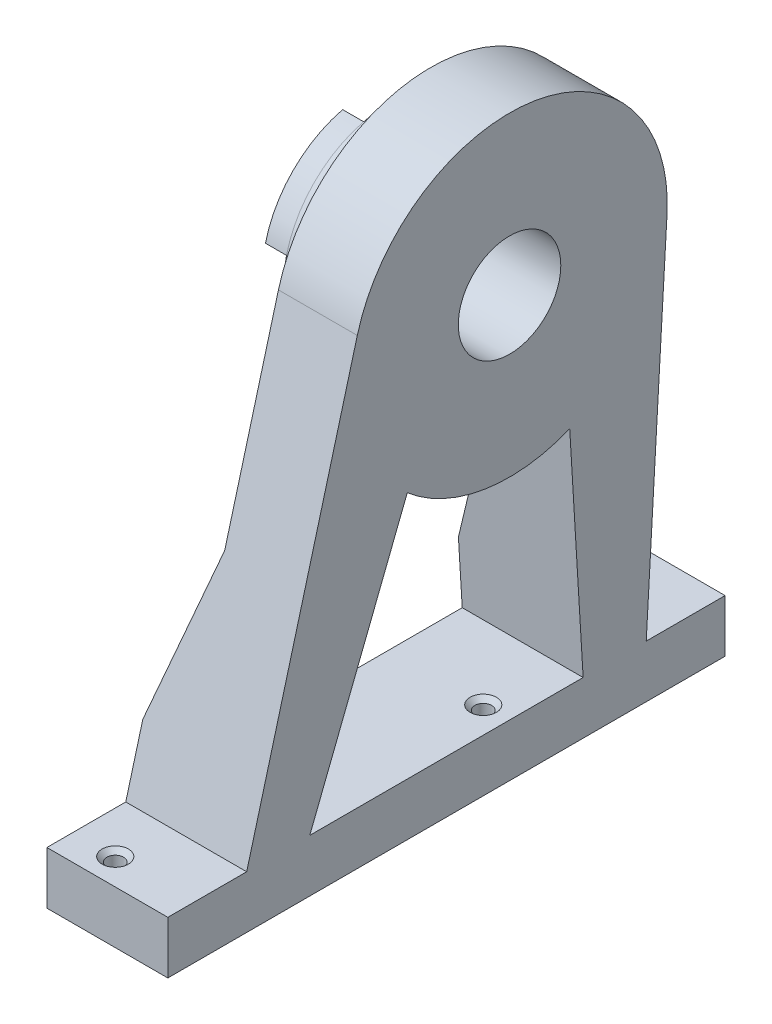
ISO-10303-21;
HEADER;
FILE_DESCRIPTION(('STEP AP214'),'2;1');
FILE_NAME('part.step','',(''),(''),'','','');
FILE_SCHEMA(('AUTOMOTIVE_DESIGN { 1 0 10303 214 1 1 1 1 }'));
ENDSEC;
DATA;
#1=APPLICATION_CONTEXT('core data for automotive mechanical design processes');
#2=APPLICATION_PROTOCOL_DEFINITION('international standard','automotive_design',2000,#1);
#3=PRODUCT_CONTEXT('',#1,'mechanical');
#4=PRODUCT('Part','Part','',(#3));
#5=PRODUCT_RELATED_PRODUCT_CATEGORY('part','',(#4));
#6=PRODUCT_DEFINITION_FORMATION('','',#4);
#7=PRODUCT_DEFINITION_CONTEXT('part definition',#1,'design');
#8=PRODUCT_DEFINITION('design','',#6,#7);
#9=PRODUCT_DEFINITION_SHAPE('','',#8);
#10=(LENGTH_UNIT() NAMED_UNIT(*) SI_UNIT(.MILLI.,.METRE.));
#11=(NAMED_UNIT(*) PLANE_ANGLE_UNIT() SI_UNIT($,.RADIAN.));
#12=(NAMED_UNIT(*) SI_UNIT($,.STERADIAN.) SOLID_ANGLE_UNIT());
#13=UNCERTAINTY_MEASURE_WITH_UNIT(LENGTH_MEASURE(1.E-05),#10,'distance_accuracy_value','');
#14=(GEOMETRIC_REPRESENTATION_CONTEXT(3) GLOBAL_UNCERTAINTY_ASSIGNED_CONTEXT((#13)) GLOBAL_UNIT_ASSIGNED_CONTEXT((#10,
#11,#12)) REPRESENTATION_CONTEXT('',''));
#15=CARTESIAN_POINT('',(0.,0.,0.));
#16=DIRECTION('',(0.,0.,1.));
#17=DIRECTION('',(1.,0.,0.));
#18=AXIS2_PLACEMENT_3D('',#15,#16,#17);
#19=CARTESIAN_POINT('',(-27.,80.,0.));
#20=DIRECTION('',(1.,0.,0.));
#21=DIRECTION('',(0.,0.,-1.));
#22=AXIS2_PLACEMENT_3D('',#19,#20,#21);
#23=CYLINDRICAL_SURFACE('',#22,20.);
#24=DIRECTION('',(-1.,0.,0.));
#25=VECTOR('',#24,1.);
#26=CARTESIAN_POINT('',(-23.,75.25,-19.4277507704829));
#27=LINE('',#26,#25);
#28=CARTESIAN_POINT('',(-23.,75.25,-19.4277507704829));
#29=VERTEX_POINT('',#28);
#30=CARTESIAN_POINT('',(-27.,75.25,-19.4277507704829));
#31=VERTEX_POINT('',#30);
#32=EDGE_CURVE('E596',#29,#31,#27,.T.);
#33=ORIENTED_EDGE('',*,*,#32,.F.);
#34=CARTESIAN_POINT('',(-23.,80.,0.));
#35=DIRECTION('',(1.,0.,0.));
#36=DIRECTION('',(0.,1.,0.));
#37=AXIS2_PLACEMENT_3D('',#34,#35,#36);
#38=CIRCLE('',#37,20.);
#39=CARTESIAN_POINT('',(-23.,60.5722492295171,-4.75));
#40=VERTEX_POINT('',#39);
#41=EDGE_CURVE('E12',#29,#40,#38,.F.);
#42=ORIENTED_EDGE('',*,*,#41,.T.);
#43=DIRECTION('',(-1.,0.,0.));
#44=VECTOR('',#43,1.);
#45=CARTESIAN_POINT('',(-23.,60.5722492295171,-4.75));
#46=LINE('',#45,#44);
#47=CARTESIAN_POINT('',(-27.,60.5722492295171,-4.74999999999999));
#48=VERTEX_POINT('',#47);
#49=EDGE_CURVE('E601',#40,#48,#46,.T.);
#50=ORIENTED_EDGE('',*,*,#49,.T.);
#51=CARTESIAN_POINT('',(-27.,80.,0.));
#52=DIRECTION('',(1.,0.,0.));
#53=DIRECTION('',(0.,0.,-1.));
#54=AXIS2_PLACEMENT_3D('',#51,#52,#53);
#55=CIRCLE('',#54,20.);
#56=EDGE_CURVE('E317',#48,#31,#55,.T.);
#57=ORIENTED_EDGE('',*,*,#56,.T.);
#58=EDGE_LOOP('',(#33,#42,#50,#57));
#59=FACE_BOUND('',#58,.T.);
#60=ADVANCED_FACE('F33',(#59),#23,.T.);
#61=CARTESIAN_POINT('',(-25.,9.99999999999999,50.));
#62=DIRECTION('',(0.,0.260963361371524,0.965348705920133));
#63=DIRECTION('',(0.,-0.965348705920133,0.260963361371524));
#64=AXIS2_PLACEMENT_3D('',#61,#62,#63);
#65=PLANE('',#64);
#66=DIRECTION('',(0.26588586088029,0.930600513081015,-0.251569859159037));
#67=VECTOR('',#66,1.);
#68=CARTESIAN_POINT('',(-26.3275781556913,10.3534764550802,49.9044444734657));
#69=LINE('',#68,#67);
#70=CARTESIAN_POINT('',(-23.,22.,46.7560319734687));
#71=VERTEX_POINT('',#70);
#72=CARTESIAN_POINT('',(-15.,50.,39.1867732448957));
#73=VERTEX_POINT('',#72);
#74=EDGE_CURVE('E343',#71,#73,#69,.T.);
#75=ORIENTED_EDGE('',*,*,#74,.F.);
#76=DIRECTION('',(0.,-0.965348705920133,0.260963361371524));
#77=VECTOR('',#76,1.);
#78=CARTESIAN_POINT('',(-23.,9.99999999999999,50.));
#79=LINE('',#78,#77);
#80=CARTESIAN_POINT('',(-23.,9.99999999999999,50.));
#81=VERTEX_POINT('',#80);
#82=EDGE_CURVE('E48',#71,#81,#79,.T.);
#83=ORIENTED_EDGE('',*,*,#82,.T.);
#84=DIRECTION('',(1.,0.,0.));
#85=VECTOR('',#84,1.);
#86=CARTESIAN_POINT('',(-25.,9.99999999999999,50.));
#87=LINE('',#86,#85);
#88=CARTESIAN_POINT('',(0.,9.99999999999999,50.));
#89=VERTEX_POINT('',#88);
#90=EDGE_CURVE('E389',#81,#89,#87,.T.);
#91=ORIENTED_EDGE('',*,*,#90,.T.);
#92=DIRECTION('',(0.,-0.965348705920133,0.260963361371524));
#93=VECTOR('',#92,1.);
#94=CARTESIAN_POINT('',(0.,9.99999999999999,50.));
#95=LINE('',#94,#93);
#96=CARTESIAN_POINT('',(0.,87.8289008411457,28.960461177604));
#97=VERTEX_POINT('',#96);
#98=EDGE_CURVE('E360',#97,#89,#95,.T.);
#99=ORIENTED_EDGE('',*,*,#98,.F.);
#100=DIRECTION('',(1.,0.,0.));
#101=VECTOR('',#100,1.);
#102=CARTESIAN_POINT('',(-25.,87.8289008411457,28.960461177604));
#103=LINE('',#102,#101);
#104=CARTESIAN_POINT('',(-15.,87.8289008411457,28.960461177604));
#105=VERTEX_POINT('',#104);
#106=EDGE_CURVE('E390',#105,#97,#103,.T.);
#107=ORIENTED_EDGE('',*,*,#106,.F.);
#108=DIRECTION('',(0.,0.965348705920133,-0.260963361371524));
#109=VECTOR('',#108,1.);
#110=CARTESIAN_POINT('',(-15.,9.99999999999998,50.));
#111=LINE('',#110,#109);
#112=EDGE_CURVE('E335',#73,#105,#111,.T.);
#113=ORIENTED_EDGE('',*,*,#112,.F.);
#114=EDGE_LOOP('',(#75,#83,#91,#99,#107,#113));
#115=FACE_BOUND('',#114,.T.);
#116=ADVANCED_FACE('F458',(#115),#65,.T.);
#117=CARTESIAN_POINT('',(-25.,9.99999999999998,-26.));
#118=DIRECTION('',(0.,-0.057763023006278,-0.998330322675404));
#119=DIRECTION('',(0.,0.998330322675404,-0.057763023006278));
#120=AXIS2_PLACEMENT_3D('',#117,#118,#119);
#121=PLANE('',#120);
#122=DIRECTION('',(1.,0.,0.));
#123=VECTOR('',#122,1.);
#124=CARTESIAN_POINT('',(-25.,9.99999999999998,-26.));
#125=LINE('',#124,#123);
#126=CARTESIAN_POINT('',(-23.,9.99999999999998,-26.));
#127=VERTEX_POINT('',#126);
#128=CARTESIAN_POINT('',(0.,9.99999999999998,-26.));
#129=VERTEX_POINT('',#128);
#130=EDGE_CURVE('E395',#127,#129,#125,.T.);
#131=ORIENTED_EDGE('',*,*,#130,.F.);
#132=DIRECTION('',(0.,0.998330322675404,-0.057763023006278));
#133=VECTOR('',#132,1.);
#134=CARTESIAN_POINT('',(-23.,9.99999999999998,-26.));
#135=LINE('',#134,#133);
#136=CARTESIAN_POINT('',(-23.,22.,-26.6943155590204));
#137=VERTEX_POINT('',#136);
#138=EDGE_CURVE('E292',#127,#137,#135,.T.);
#139=ORIENTED_EDGE('',*,*,#138,.T.);
#140=DIRECTION('',(-0.274296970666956,-0.960039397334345,0.0555475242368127));
#141=VECTOR('',#140,1.);
#142=CARTESIAN_POINT('',(-26.3210873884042,10.3761941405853,-26.0217664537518));
#143=LINE('',#142,#141);
#144=CARTESIAN_POINT('',(-15.,50.,-28.3143851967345));
#145=VERTEX_POINT('',#144);
#146=EDGE_CURVE('E340',#145,#137,#143,.T.);
#147=ORIENTED_EDGE('',*,*,#146,.F.);
#148=DIRECTION('',(0.,-0.998330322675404,0.057763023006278));
#149=VECTOR('',#148,1.);
#150=CARTESIAN_POINT('',(-15.,9.99999999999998,-26.));
#151=LINE('',#150,#149);
#152=CARTESIAN_POINT('',(-15.,78.2671093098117,-29.9499096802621));
#153=VERTEX_POINT('',#152);
#154=EDGE_CURVE('E331',#153,#145,#151,.T.);
#155=ORIENTED_EDGE('',*,*,#154,.F.);
#156=DIRECTION('',(1.,0.,0.));
#157=VECTOR('',#156,1.);
#158=CARTESIAN_POINT('',(-25.,78.2671093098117,-29.9499096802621));
#159=LINE('',#158,#157);
#160=CARTESIAN_POINT('',(0.,78.2671093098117,-29.9499096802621));
#161=VERTEX_POINT('',#160);
#162=EDGE_CURVE('E393',#153,#161,#159,.T.);
#163=ORIENTED_EDGE('',*,*,#162,.T.);
#164=DIRECTION('',(0.,0.998330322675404,-0.057763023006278));
#165=VECTOR('',#164,1.);
#166=CARTESIAN_POINT('',(0.,9.99999999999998,-26.));
#167=LINE('',#166,#165);
#168=EDGE_CURVE('E383',#129,#161,#167,.T.);
#169=ORIENTED_EDGE('',*,*,#168,.F.);
#170=EDGE_LOOP('',(#131,#139,#147,#155,#163,#169));
#171=FACE_BOUND('',#170,.T.);
#172=ADVANCED_FACE('F464',(#171),#121,.T.);
#173=CARTESIAN_POINT('',(-25.,10.,-41.));
#174=DIRECTION('',(0.,1.,0.));
#175=DIRECTION('',(0.,0.,1.));
#176=AXIS2_PLACEMENT_3D('',#173,#174,#175);
#177=PLANE('',#176);
#178=CARTESIAN_POINT('',(-15.,9.99999999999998,-36.));
#179=DIRECTION('',(0.,1.,0.));
#180=DIRECTION('',(0.,0.,1.));
#181=AXIS2_PLACEMENT_3D('',#178,#179,#180);
#182=CIRCLE('',#181,2.5);
#183=CARTESIAN_POINT('',(-15.,9.99999999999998,-33.5));
#184=VERTEX_POINT('',#183);
#185=EDGE_CURVE('E910',#184,#184,#182,.T.);
#186=ORIENTED_EDGE('',*,*,#185,.F.);
#187=EDGE_LOOP('',(#186));
#188=FACE_BOUND('',#187,.T.);
#189=DIRECTION('',(1.,0.,0.));
#190=VECTOR('',#189,1.);
#191=CARTESIAN_POINT('',(-25.,10.,-41.));
#192=LINE('',#191,#190);
#193=CARTESIAN_POINT('',(-23.,10.,-41.));
#194=VERTEX_POINT('',#193);
#195=CARTESIAN_POINT('',(0.,10.,-41.));
#196=VERTEX_POINT('',#195);
#197=EDGE_CURVE('E397',#194,#196,#192,.T.);
#198=ORIENTED_EDGE('',*,*,#197,.F.);
#199=DIRECTION('',(0.,0.,1.));
#200=VECTOR('',#199,1.);
#201=CARTESIAN_POINT('',(-23.,10.,-41.));
#202=LINE('',#201,#200);
#203=EDGE_CURVE('E289',#194,#127,#202,.T.);
#204=ORIENTED_EDGE('',*,*,#203,.T.);
#205=ORIENTED_EDGE('',*,*,#130,.T.);
#206=DIRECTION('',(0.,0.,1.));
#207=VECTOR('',#206,1.);
#208=CARTESIAN_POINT('',(0.,10.,-41.));
#209=LINE('',#208,#207);
#210=EDGE_CURVE('E380',#196,#129,#209,.T.);
#211=ORIENTED_EDGE('',*,*,#210,.F.);
#212=EDGE_LOOP('',(#198,#204,#205,#211));
#213=FACE_BOUND('',#212,.T.);
#214=ADVANCED_FACE('F515',(#188,#213),#177,.T.);
#215=CARTESIAN_POINT('',(-25.,10.,-41.));
#216=DIRECTION('',(0.,0.,-1.));
#217=DIRECTION('',(-1.,0.,0.));
#218=AXIS2_PLACEMENT_3D('',#215,#216,#217);
#219=PLANE('',#218);
#220=DIRECTION('',(1.,0.,0.));
#221=VECTOR('',#220,1.);
#222=CARTESIAN_POINT('',(-25.,0.,-41.));
#223=LINE('',#222,#221);
#224=CARTESIAN_POINT('',(-23.,0.,-41.));
#225=VERTEX_POINT('',#224);
#226=CARTESIAN_POINT('',(0.,0.,-41.));
#227=VERTEX_POINT('',#226);
#228=EDGE_CURVE('E399',#225,#227,#223,.T.);
#229=ORIENTED_EDGE('',*,*,#228,.F.);
#230=DIRECTION('',(0.,1.,0.));
#231=VECTOR('',#230,1.);
#232=CARTESIAN_POINT('',(-23.,10.,-41.));
#233=LINE('',#232,#231);
#234=EDGE_CURVE('E286',#225,#194,#233,.T.);
#235=ORIENTED_EDGE('',*,*,#234,.T.);
#236=ORIENTED_EDGE('',*,*,#197,.T.);
#237=DIRECTION('',(0.,1.,0.));
#238=VECTOR('',#237,1.);
#239=CARTESIAN_POINT('',(0.,10.,-41.));
#240=LINE('',#239,#238);
#241=EDGE_CURVE('E377',#227,#196,#240,.T.);
#242=ORIENTED_EDGE('',*,*,#241,.F.);
#243=EDGE_LOOP('',(#229,#235,#236,#242));
#244=FACE_BOUND('',#243,.T.);
#245=ADVANCED_FACE('F519',(#244),#219,.T.);
#246=CARTESIAN_POINT('',(-25.,0.,-41.));
#247=DIRECTION('',(0.,-1.,0.));
#248=DIRECTION('',(0.,0.,-1.));
#249=AXIS2_PLACEMENT_3D('',#246,#247,#248);
#250=PLANE('',#249);
#251=CARTESIAN_POINT('',(-5.,0.,0.));
#252=DIRECTION('',(0.,-1.,0.));
#253=DIRECTION('',(0.,0.,-1.));
#254=AXIS2_PLACEMENT_3D('',#251,#252,#253);
#255=CIRCLE('',#254,1.59999999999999);
#256=CARTESIAN_POINT('',(-5.,0.,-1.59999999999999));
#257=VERTEX_POINT('',#256);
#258=EDGE_CURVE('E905',#257,#257,#255,.T.);
#259=ORIENTED_EDGE('',*,*,#258,.F.);
#260=EDGE_LOOP('',(#259));
#261=FACE_BOUND('',#260,.T.);
#262=CARTESIAN_POINT('',(-15.,0.,-36.));
#263=DIRECTION('',(0.,-1.,0.));
#264=DIRECTION('',(0.,0.,-1.));
#265=AXIS2_PLACEMENT_3D('',#262,#263,#264);
#266=CIRCLE('',#265,1.59999999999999);
#267=CARTESIAN_POINT('',(-15.,0.,-37.6));
#268=VERTEX_POINT('',#267);
#269=EDGE_CURVE('E916',#268,#268,#266,.T.);
#270=ORIENTED_EDGE('',*,*,#269,.F.);
#271=EDGE_LOOP('',(#270));
#272=FACE_BOUND('',#271,.T.);
#273=CARTESIAN_POINT('',(-15.,0.,60.));
#274=DIRECTION('',(0.,-1.,0.));
#275=DIRECTION('',(0.,0.,-1.));
#276=AXIS2_PLACEMENT_3D('',#273,#274,#275);
#277=CIRCLE('',#276,1.59999999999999);
#278=CARTESIAN_POINT('',(-15.,0.,58.4));
#279=VERTEX_POINT('',#278);
#280=EDGE_CURVE('E925',#279,#279,#277,.T.);
#281=ORIENTED_EDGE('',*,*,#280,.F.);
#282=EDGE_LOOP('',(#281));
#283=FACE_BOUND('',#282,.T.);
#284=DIRECTION('',(1.,0.,0.));
#285=VECTOR('',#284,1.);
#286=CARTESIAN_POINT('',(-25.,0.,65.));
#287=LINE('',#286,#285);
#288=CARTESIAN_POINT('',(-23.,0.,65.));
#289=VERTEX_POINT('',#288);
#290=CARTESIAN_POINT('',(0.,0.,65.));
#291=VERTEX_POINT('',#290);
#292=EDGE_CURVE('E401',#289,#291,#287,.T.);
#293=ORIENTED_EDGE('',*,*,#292,.F.);
#294=DIRECTION('',(0.,0.,-1.));
#295=VECTOR('',#294,1.);
#296=CARTESIAN_POINT('',(-23.,0.,-41.));
#297=LINE('',#296,#295);
#298=EDGE_CURVE('E283',#289,#225,#297,.T.);
#299=ORIENTED_EDGE('',*,*,#298,.T.);
#300=ORIENTED_EDGE('',*,*,#228,.T.);
#301=DIRECTION('',(0.,0.,-1.));
#302=VECTOR('',#301,1.);
#303=CARTESIAN_POINT('',(0.,0.,-41.));
#304=LINE('',#303,#302);
#305=EDGE_CURVE('E374',#291,#227,#304,.T.);
#306=ORIENTED_EDGE('',*,*,#305,.F.);
#307=EDGE_LOOP('',(#293,#299,#300,#306));
#308=FACE_BOUND('',#307,.T.);
#309=ADVANCED_FACE('F523',(#261,#272,#283,#308),#250,.T.);
#310=CARTESIAN_POINT('',(-25.,9.99999999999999,65.));
#311=DIRECTION('',(0.,0.,1.));
#312=DIRECTION('',(1.,0.,0.));
#313=AXIS2_PLACEMENT_3D('',#310,#311,#312);
#314=PLANE('',#313);
#315=DIRECTION('',(1.,0.,0.));
#316=VECTOR('',#315,1.);
#317=CARTESIAN_POINT('',(-25.,9.99999999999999,65.));
#318=LINE('',#317,#316);
#319=CARTESIAN_POINT('',(-23.,9.99999999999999,65.));
#320=VERTEX_POINT('',#319);
#321=CARTESIAN_POINT('',(0.,9.99999999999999,65.));
#322=VERTEX_POINT('',#321);
#323=EDGE_CURVE('E403',#320,#322,#318,.T.);
#324=ORIENTED_EDGE('',*,*,#323,.F.);
#325=DIRECTION('',(0.,-1.,0.));
#326=VECTOR('',#325,1.);
#327=CARTESIAN_POINT('',(-23.,9.99999999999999,65.));
#328=LINE('',#327,#326);
#329=EDGE_CURVE('E280',#320,#289,#328,.T.);
#330=ORIENTED_EDGE('',*,*,#329,.T.);
#331=ORIENTED_EDGE('',*,*,#292,.T.);
#332=DIRECTION('',(0.,-1.,0.));
#333=VECTOR('',#332,1.);
#334=CARTESIAN_POINT('',(0.,9.99999999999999,65.));
#335=LINE('',#334,#333);
#336=EDGE_CURVE('E371',#322,#291,#335,.T.);
#337=ORIENTED_EDGE('',*,*,#336,.F.);
#338=EDGE_LOOP('',(#324,#330,#331,#337));
#339=FACE_BOUND('',#338,.T.);
#340=ADVANCED_FACE('F527',(#339),#314,.T.);
#341=CARTESIAN_POINT('',(-25.,9.99999999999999,65.));
#342=DIRECTION('',(0.,1.,0.));
#343=DIRECTION('',(0.,0.,1.));
#344=AXIS2_PLACEMENT_3D('',#341,#342,#343);
#345=PLANE('',#344);
#346=CARTESIAN_POINT('',(-15.,9.99999999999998,60.));
#347=DIRECTION('',(0.,1.,0.));
#348=DIRECTION('',(0.,0.,1.));
#349=AXIS2_PLACEMENT_3D('',#346,#347,#348);
#350=CIRCLE('',#349,2.5);
#351=CARTESIAN_POINT('',(-15.,9.99999999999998,62.5));
#352=VERTEX_POINT('',#351);
#353=EDGE_CURVE('E919',#352,#352,#350,.T.);
#354=ORIENTED_EDGE('',*,*,#353,.F.);
#355=EDGE_LOOP('',(#354));
#356=FACE_BOUND('',#355,.T.);
#357=ORIENTED_EDGE('',*,*,#90,.F.);
#358=DIRECTION('',(0.,0.,1.));
#359=VECTOR('',#358,1.);
#360=CARTESIAN_POINT('',(-23.,9.99999999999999,65.));
#361=LINE('',#360,#359);
#362=EDGE_CURVE('E277',#81,#320,#361,.T.);
#363=ORIENTED_EDGE('',*,*,#362,.T.);
#364=ORIENTED_EDGE('',*,*,#323,.T.);
#365=DIRECTION('',(0.,0.,1.));
#366=VECTOR('',#365,1.);
#367=CARTESIAN_POINT('',(0.,9.99999999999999,65.));
#368=LINE('',#367,#366);
#369=EDGE_CURVE('E368',#89,#322,#368,.T.);
#370=ORIENTED_EDGE('',*,*,#369,.F.);
#371=EDGE_LOOP('',(#357,#363,#364,#370));
#372=FACE_BOUND('',#371,.T.);
#373=ADVANCED_FACE('F492',(#356,#372),#345,.T.);
#374=CARTESIAN_POINT('',(-25.,9.99999999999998,-14.));
#375=DIRECTION('',(0.,0.0603497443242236,-0.998177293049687));
#376=DIRECTION('',(0.,0.998177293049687,0.0603497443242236));
#377=AXIS2_PLACEMENT_3D('',#374,#375,#376);
#378=PLANE('',#377);
#379=DIRECTION('',(0.,0.998177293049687,0.0603497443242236));
#380=VECTOR('',#379,1.);
#381=CARTESIAN_POINT('',(-23.,9.99999999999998,-14.));
#382=LINE('',#381,#380);
#383=CARTESIAN_POINT('',(-23.,9.99999999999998,-14.));
#384=VERTEX_POINT('',#383);
#385=CARTESIAN_POINT('',(-23.,22.,-13.2744806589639));
#386=VERTEX_POINT('',#385);
#387=EDGE_CURVE('E272',#384,#386,#382,.T.);
#388=ORIENTED_EDGE('',*,*,#387,.F.);
#389=DIRECTION('',(1.,0.,0.));
#390=VECTOR('',#389,1.);
#391=CARTESIAN_POINT('',(-25.,9.99999999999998,-14.));
#392=LINE('',#391,#390);
#393=CARTESIAN_POINT('',(0.,9.99999999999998,-14.));
#394=VERTEX_POINT('',#393);
#395=EDGE_CURVE('E361',#384,#394,#392,.T.);
#396=ORIENTED_EDGE('',*,*,#395,.T.);
#397=DIRECTION('',(0.,0.998177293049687,0.0603497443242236));
#398=VECTOR('',#397,1.);
#399=CARTESIAN_POINT('',(0.,9.99999999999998,-14.));
#400=LINE('',#399,#398);
#401=CARTESIAN_POINT('',(0.,52.268702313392,-11.4444365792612));
#402=VERTEX_POINT('',#401);
#403=EDGE_CURVE('E354',#394,#402,#400,.T.);
#404=ORIENTED_EDGE('',*,*,#403,.T.);
#405=DIRECTION('',(1.,0.,0.));
#406=VECTOR('',#405,1.);
#407=CARTESIAN_POINT('',(-25.,52.268702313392,-11.4444365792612));
#408=LINE('',#407,#406);
#409=CARTESIAN_POINT('',(-15.,52.268702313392,-11.4444365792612));
#410=VERTEX_POINT('',#409);
#411=EDGE_CURVE('E358',#410,#402,#408,.T.);
#412=ORIENTED_EDGE('',*,*,#411,.F.);
#413=DIRECTION('',(0.,-0.998177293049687,-0.0603497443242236));
#414=VECTOR('',#413,1.);
#415=CARTESIAN_POINT('',(-15.,9.99999999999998,-14.));
#416=LINE('',#415,#414);
#417=CARTESIAN_POINT('',(-15.,50.,-11.5816021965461));
#418=VERTEX_POINT('',#417);
#419=EDGE_CURVE('E328',#410,#418,#416,.T.);
#420=ORIENTED_EDGE('',*,*,#419,.T.);
#421=DIRECTION('',(-0.274258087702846,-0.959903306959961,-0.0580357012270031));
#422=VECTOR('',#421,1.);
#423=CARTESIAN_POINT('',(-26.3211178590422,10.3760874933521,-13.9772617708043));
#424=LINE('',#423,#422);
#425=EDGE_CURVE('E337',#418,#386,#424,.T.);
#426=ORIENTED_EDGE('',*,*,#425,.T.);
#427=EDGE_LOOP('',(#388,#396,#404,#412,#420,#426));
#428=FACE_BOUND('',#427,.T.);
#429=ADVANCED_FACE('F488',(#428),#378,.F.);
#430=CARTESIAN_POINT('',(-25.,9.99999999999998,38.));
#431=DIRECTION('',(0.,-1.,0.));
#432=DIRECTION('',(0.,0.,-1.));
#433=AXIS2_PLACEMENT_3D('',#430,#431,#432);
#434=PLANE('',#433);
#435=CARTESIAN_POINT('',(-5.,9.99999999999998,0.));
#436=DIRECTION('',(0.,1.,0.));
#437=DIRECTION('',(0.,0.,1.));
#438=AXIS2_PLACEMENT_3D('',#435,#436,#437);
#439=CIRCLE('',#438,2.5);
#440=CARTESIAN_POINT('',(-5.,9.99999999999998,2.5));
#441=VERTEX_POINT('',#440);
#442=EDGE_CURVE('E903',#441,#441,#439,.T.);
#443=ORIENTED_EDGE('',*,*,#442,.F.);
#444=EDGE_LOOP('',(#443));
#445=FACE_BOUND('',#444,.T.);
#446=DIRECTION('',(0.,0.,-1.));
#447=VECTOR('',#446,1.);
#448=CARTESIAN_POINT('',(-23.,9.99999999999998,38.));
#449=LINE('',#448,#447);
#450=CARTESIAN_POINT('',(-23.,9.99999999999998,38.));
#451=VERTEX_POINT('',#450);
#452=EDGE_CURVE('E270',#451,#384,#449,.T.);
#453=ORIENTED_EDGE('',*,*,#452,.F.);
#454=DIRECTION('',(1.,0.,0.));
#455=VECTOR('',#454,1.);
#456=CARTESIAN_POINT('',(-25.,9.99999999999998,38.));
#457=LINE('',#456,#455);
#458=CARTESIAN_POINT('',(0.,9.99999999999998,38.));
#459=VERTEX_POINT('',#458);
#460=EDGE_CURVE('E363',#451,#459,#457,.T.);
#461=ORIENTED_EDGE('',*,*,#460,.T.);
#462=DIRECTION('',(0.,0.,-1.));
#463=VECTOR('',#462,1.);
#464=CARTESIAN_POINT('',(0.,9.99999999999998,38.));
#465=LINE('',#464,#463);
#466=EDGE_CURVE('E351',#459,#394,#465,.T.);
#467=ORIENTED_EDGE('',*,*,#466,.T.);
#468=ORIENTED_EDGE('',*,*,#395,.F.);
#469=EDGE_LOOP('',(#453,#461,#467,#468));
#470=FACE_BOUND('',#469,.T.);
#471=ADVANCED_FACE('F491',(#445,#470),#434,.F.);
#472=CARTESIAN_POINT('',(-25.,9.99999999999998,38.));
#473=DIRECTION('',(0.,0.365921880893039,0.930645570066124));
#474=DIRECTION('',(0.,-0.930645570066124,0.365921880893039));
#475=AXIS2_PLACEMENT_3D('',#472,#473,#474);
#476=PLANE('',#475);
#477=DIRECTION('',(0.,-0.930645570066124,0.365921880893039));
#478=VECTOR('',#477,1.);
#479=CARTESIAN_POINT('',(-23.,9.99999999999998,38.));
#480=LINE('',#479,#478);
#481=CARTESIAN_POINT('',(-23.,22.,33.2817026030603));
#482=VERTEX_POINT('',#481);
#483=EDGE_CURVE('E264',#482,#451,#480,.T.);
#484=ORIENTED_EDGE('',*,*,#483,.F.);
#485=DIRECTION('',(0.256969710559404,0.899393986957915,-0.353634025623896));
#486=VECTOR('',#485,1.);
#487=CARTESIAN_POINT('',(-26.3342379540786,10.3301671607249,37.8701810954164));
#488=LINE('',#487,#486);
#489=CARTESIAN_POINT('',(-15.,50.,22.272342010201));
#490=VERTEX_POINT('',#489);
#491=EDGE_CURVE('E408',#482,#490,#488,.T.);
#492=ORIENTED_EDGE('',*,*,#491,.T.);
#493=DIRECTION('',(0.,0.930645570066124,-0.365921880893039));
#494=VECTOR('',#493,1.);
#495=CARTESIAN_POINT('',(-15.,9.99999999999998,38.));
#496=LINE('',#495,#494);
#497=CARTESIAN_POINT('',(-15.,57.1640015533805,19.4555178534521));
#498=VERTEX_POINT('',#497);
#499=EDGE_CURVE('E392',#490,#498,#496,.T.);
#500=ORIENTED_EDGE('',*,*,#499,.T.);
#501=DIRECTION('',(1.,0.,0.));
#502=VECTOR('',#501,1.);
#503=CARTESIAN_POINT('',(-25.,57.1640015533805,19.4555178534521));
#504=LINE('',#503,#502);
#505=CARTESIAN_POINT('',(0.,57.1640015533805,19.4555178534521));
#506=VERTEX_POINT('',#505);
#507=EDGE_CURVE('E357',#498,#506,#504,.T.);
#508=ORIENTED_EDGE('',*,*,#507,.T.);
#509=DIRECTION('',(0.,-0.930645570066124,0.365921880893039));
#510=VECTOR('',#509,1.);
#511=CARTESIAN_POINT('',(0.,9.99999999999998,38.));
#512=LINE('',#511,#510);
#513=EDGE_CURVE('E348',#506,#459,#512,.T.);
#514=ORIENTED_EDGE('',*,*,#513,.T.);
#515=ORIENTED_EDGE('',*,*,#460,.F.);
#516=EDGE_LOOP('',(#484,#492,#500,#508,#514,#515));
#517=FACE_BOUND('',#516,.T.);
#518=ADVANCED_FACE('F485',(#517),#476,.F.);
#519=CARTESIAN_POINT('',(-15.,50.,65.));
#520=DIRECTION('',(0.961523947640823,-0.274721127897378,0.));
#521=DIRECTION('',(0.274721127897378,0.961523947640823,0.));
#522=AXIS2_PLACEMENT_3D('',#519,#520,#521);
#523=PLANE('',#522);
#524=DIRECTION('',(0.,0.,-1.));
#525=VECTOR('',#524,1.);
#526=CARTESIAN_POINT('',(-23.,22.,65.));
#527=LINE('',#526,#525);
#528=EDGE_CURVE('E275',#386,#137,#527,.T.);
#529=ORIENTED_EDGE('',*,*,#528,.F.);
#530=ORIENTED_EDGE('',*,*,#425,.F.);
#531=DIRECTION('',(0.,0.,-1.));
#532=VECTOR('',#531,1.);
#533=CARTESIAN_POINT('',(-15.,50.,65.));
#534=LINE('',#533,#532);
#535=EDGE_CURVE('E322',#418,#145,#534,.T.);
#536=ORIENTED_EDGE('',*,*,#535,.T.);
#537=ORIENTED_EDGE('',*,*,#146,.T.);
#538=EDGE_LOOP('',(#529,#530,#536,#537));
#539=FACE_BOUND('',#538,.T.);
#540=ADVANCED_FACE('F479',(#539),#523,.F.);
#541=DIRECTION('',(0.,0.,-1.));
#542=VECTOR('',#541,1.);
#543=CARTESIAN_POINT('',(-23.,22.,65.));
#544=LINE('',#543,#542);
#545=EDGE_CURVE('E261',#71,#482,#544,.T.);
#546=ORIENTED_EDGE('',*,*,#545,.F.);
#547=ORIENTED_EDGE('',*,*,#74,.T.);
#548=EDGE_CURVE('E325',#73,#490,#534,.T.);
#549=ORIENTED_EDGE('',*,*,#548,.T.);
#550=ORIENTED_EDGE('',*,*,#491,.F.);
#551=EDGE_LOOP('',(#546,#547,#549,#550));
#552=FACE_BOUND('',#551,.T.);
#553=ADVANCED_FACE('F472',(#552),#523,.F.);
#554=DIRECTION('',(-1.,0.,0.));
#555=VECTOR('',#554,1.);
#556=CARTESIAN_POINT('',(-23.,84.75,19.4277507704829));
#557=LINE('',#556,#555);
#558=CARTESIAN_POINT('',(-23.,84.75,19.4277507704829));
#559=VERTEX_POINT('',#558);
#560=CARTESIAN_POINT('',(-27.,84.75,19.4277507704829));
#561=VERTEX_POINT('',#560);
#562=EDGE_CURVE('E237',#559,#561,#557,.T.);
#563=ORIENTED_EDGE('',*,*,#562,.F.);
#564=CARTESIAN_POINT('',(-23.,80.,0.));
#565=DIRECTION('',(1.,0.,0.));
#566=DIRECTION('',(0.,1.,0.));
#567=AXIS2_PLACEMENT_3D('',#564,#565,#566);
#568=CIRCLE('',#567,20.);
#569=CARTESIAN_POINT('',(-23.,99.4277507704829,4.75));
#570=VERTEX_POINT('',#569);
#571=EDGE_CURVE('E41',#559,#570,#568,.F.);
#572=ORIENTED_EDGE('',*,*,#571,.T.);
#573=DIRECTION('',(-1.,0.,0.));
#574=VECTOR('',#573,1.);
#575=CARTESIAN_POINT('',(-23.,99.4277507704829,4.75));
#576=LINE('',#575,#574);
#577=CARTESIAN_POINT('',(-27.,99.4277507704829,4.75));
#578=VERTEX_POINT('',#577);
#579=EDGE_CURVE('E234',#570,#578,#576,.T.);
#580=ORIENTED_EDGE('',*,*,#579,.T.);
#581=EDGE_CURVE('E320',#578,#561,#55,.T.);
#582=ORIENTED_EDGE('',*,*,#581,.T.);
#583=EDGE_LOOP('',(#563,#572,#580,#582));
#584=FACE_BOUND('',#583,.T.);
#585=ADVANCED_FACE('F232',(#584),#23,.T.);
#586=CARTESIAN_POINT('',(-27.,80.,0.));
#587=DIRECTION('',(1.,0.,0.));
#588=DIRECTION('',(0.,0.,-1.));
#589=AXIS2_PLACEMENT_3D('',#586,#587,#588);
#590=PLANE('',#589);
#591=DIRECTION('',(0.,0.,1.));
#592=VECTOR('',#591,1.);
#593=CARTESIAN_POINT('',(-27.,75.25,-9.25));
#594=LINE('',#593,#592);
#595=CARTESIAN_POINT('',(-27.,75.25,-4.75));
#596=VERTEX_POINT('',#595);
#597=EDGE_CURVE('E300',#31,#596,#594,.T.);
#598=ORIENTED_EDGE('',*,*,#597,.F.);
#599=ORIENTED_EDGE('',*,*,#56,.F.);
#600=DIRECTION('',(0.,1.,0.));
#601=VECTOR('',#600,1.);
#602=CARTESIAN_POINT('',(-27.,75.25,-4.75));
#603=LINE('',#602,#601);
#604=EDGE_CURVE('E607',#48,#596,#603,.T.);
#605=ORIENTED_EDGE('',*,*,#604,.T.);
#606=EDGE_LOOP('',(#598,#599,#605));
#607=FACE_BOUND('',#606,.T.);
#608=ADVANCED_FACE('F471',(#607),#590,.F.);
#609=DIRECTION('',(0.,0.,-1.));
#610=VECTOR('',#609,1.);
#611=CARTESIAN_POINT('',(-27.,84.75,-9.25));
#612=LINE('',#611,#610);
#613=CARTESIAN_POINT('',(-27.,84.75,4.75));
#614=VERTEX_POINT('',#613);
#615=EDGE_CURVE('E295',#561,#614,#612,.T.);
#616=ORIENTED_EDGE('',*,*,#615,.F.);
#617=ORIENTED_EDGE('',*,*,#581,.F.);
#618=DIRECTION('',(0.,-1.,0.));
#619=VECTOR('',#618,1.);
#620=CARTESIAN_POINT('',(-27.,99.4277507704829,4.75));
#621=LINE('',#620,#619);
#622=EDGE_CURVE('E248',#578,#614,#621,.T.);
#623=ORIENTED_EDGE('',*,*,#622,.T.);
#624=EDGE_LOOP('',(#616,#617,#623));
#625=FACE_BOUND('',#624,.T.);
#626=ADVANCED_FACE('F477',(#625),#590,.F.);
#627=CARTESIAN_POINT('',(-19.,75.25,9.25));
#628=DIRECTION('',(0.,0.,1.));
#629=DIRECTION('',(1.,0.,0.));
#630=AXIS2_PLACEMENT_3D('',#627,#628,#629);
#631=PLANE('',#630);
#632=DIRECTION('',(0.,-1.,0.));
#633=VECTOR('',#632,1.);
#634=CARTESIAN_POINT('',(-23.,75.25,9.25));
#635=LINE('',#634,#633);
#636=CARTESIAN_POINT('',(-23.,81.75,9.25));
#637=VERTEX_POINT('',#636);
#638=CARTESIAN_POINT('',(-23.,78.25,9.25));
#639=VERTEX_POINT('',#638);
#640=EDGE_CURVE('E56',#637,#639,#635,.T.);
#641=ORIENTED_EDGE('',*,*,#640,.F.);
#642=DIRECTION('',(-1.,0.,0.));
#643=VECTOR('',#642,1.);
#644=CARTESIAN_POINT('',(-19.,81.75,9.25));
#645=LINE('',#644,#643);
#646=CARTESIAN_POINT('',(-19.,81.75,9.25));
#647=VERTEX_POINT('',#646);
#648=EDGE_CURVE('E428',#637,#647,#645,.F.);
#649=ORIENTED_EDGE('',*,*,#648,.T.);
#650=DIRECTION('',(0.,1.,0.));
#651=VECTOR('',#650,1.);
#652=CARTESIAN_POINT('',(-19.,75.25,9.25));
#653=LINE('',#652,#651);
#654=CARTESIAN_POINT('',(-19.,78.25,9.25));
#655=VERTEX_POINT('',#654);
#656=EDGE_CURVE('E296',#655,#647,#653,.T.);
#657=ORIENTED_EDGE('',*,*,#656,.F.);
#658=DIRECTION('',(-1.,0.,0.));
#659=VECTOR('',#658,1.);
#660=CARTESIAN_POINT('',(-27.,78.25,9.25));
#661=LINE('',#660,#659);
#662=EDGE_CURVE('E425',#655,#639,#661,.T.);
#663=ORIENTED_EDGE('',*,*,#662,.T.);
#664=EDGE_LOOP('',(#641,#649,#657,#663));
#665=FACE_BOUND('',#664,.T.);
#666=ADVANCED_FACE('F561',(#665),#631,.F.);
#667=CARTESIAN_POINT('',(-19.,75.25,-9.25));
#668=DIRECTION('',(0.,0.,-1.));
#669=DIRECTION('',(0.,1.,0.));
#670=AXIS2_PLACEMENT_3D('',#667,#668,#669);
#671=PLANE('',#670);
#672=DIRECTION('',(0.,1.,0.));
#673=VECTOR('',#672,1.);
#674=CARTESIAN_POINT('',(-23.,75.25,-9.25));
#675=LINE('',#674,#673);
#676=CARTESIAN_POINT('',(-23.,78.25,-9.25));
#677=VERTEX_POINT('',#676);
#678=CARTESIAN_POINT('',(-23.,81.75,-9.25));
#679=VERTEX_POINT('',#678);
#680=EDGE_CURVE('E580',#677,#679,#675,.T.);
#681=ORIENTED_EDGE('',*,*,#680,.F.);
#682=DIRECTION('',(-1.,0.,0.));
#683=VECTOR('',#682,1.);
#684=CARTESIAN_POINT('',(-19.,78.25,-9.25));
#685=LINE('',#684,#683);
#686=CARTESIAN_POINT('',(-19.,78.25,-9.25));
#687=VERTEX_POINT('',#686);
#688=EDGE_CURVE('E410',#677,#687,#685,.F.);
#689=ORIENTED_EDGE('',*,*,#688,.T.);
#690=DIRECTION('',(0.,-1.,0.));
#691=VECTOR('',#690,1.);
#692=CARTESIAN_POINT('',(-19.,75.25,-9.25));
#693=LINE('',#692,#691);
#694=CARTESIAN_POINT('',(-19.,81.75,-9.25));
#695=VERTEX_POINT('',#694);
#696=EDGE_CURVE('E303',#695,#687,#693,.T.);
#697=ORIENTED_EDGE('',*,*,#696,.F.);
#698=DIRECTION('',(-1.,0.,0.));
#699=VECTOR('',#698,1.);
#700=CARTESIAN_POINT('',(-27.,81.75,-9.25));
#701=LINE('',#700,#699);
#702=EDGE_CURVE('E412',#695,#679,#701,.T.);
#703=ORIENTED_EDGE('',*,*,#702,.T.);
#704=EDGE_LOOP('',(#681,#689,#697,#703));
#705=FACE_BOUND('',#704,.T.);
#706=ADVANCED_FACE('F539',(#705),#671,.F.);
#707=CARTESIAN_POINT('',(-19.,81.75,-6.25));
#708=DIRECTION('',(1.,0.,0.));
#709=DIRECTION('',(0.,0.,-1.));
#710=AXIS2_PLACEMENT_3D('',#707,#708,#709);
#711=CYLINDRICAL_SURFACE('',#710,3.);
#712=CARTESIAN_POINT('',(-23.,81.75,-6.25));
#713=DIRECTION('',(-1.,0.,0.));
#714=DIRECTION('',(0.,0.,1.));
#715=AXIS2_PLACEMENT_3D('',#712,#713,#714);
#716=CIRCLE('',#715,3.);
#717=CARTESIAN_POINT('',(-23.,84.75,-6.25));
#718=VERTEX_POINT('',#717);
#719=EDGE_CURVE('E577',#679,#718,#716,.F.);
#720=ORIENTED_EDGE('',*,*,#719,.F.);
#721=ORIENTED_EDGE('',*,*,#702,.F.);
#722=CARTESIAN_POINT('',(-19.,81.75,-6.25));
#723=DIRECTION('',(1.,0.,0.));
#724=DIRECTION('',(0.,0.,-1.));
#725=AXIS2_PLACEMENT_3D('',#722,#723,#724);
#726=CIRCLE('',#725,3.);
#727=CARTESIAN_POINT('',(-19.,84.75,-6.25));
#728=VERTEX_POINT('',#727);
#729=EDGE_CURVE('E430',#728,#695,#726,.F.);
#730=ORIENTED_EDGE('',*,*,#729,.F.);
#731=DIRECTION('',(-1.,0.,0.));
#732=VECTOR('',#731,1.);
#733=CARTESIAN_POINT('',(-19.,84.75,-6.25));
#734=LINE('',#733,#732);
#735=EDGE_CURVE('E418',#718,#728,#734,.F.);
#736=ORIENTED_EDGE('',*,*,#735,.F.);
#737=EDGE_LOOP('',(#720,#721,#730,#736));
#738=FACE_BOUND('',#737,.T.);
#739=ADVANCED_FACE('F535',(#738),#711,.F.);
#740=CARTESIAN_POINT('',(-19.,78.25,-6.25));
#741=DIRECTION('',(1.,0.,0.));
#742=DIRECTION('',(0.,0.,-1.));
#743=AXIS2_PLACEMENT_3D('',#740,#741,#742);
#744=CYLINDRICAL_SURFACE('',#743,3.);
#745=CARTESIAN_POINT('',(-23.,78.25,-6.25));
#746=DIRECTION('',(-1.,0.,0.));
#747=DIRECTION('',(0.,0.,1.));
#748=AXIS2_PLACEMENT_3D('',#745,#746,#747);
#749=CIRCLE('',#748,3.);
#750=CARTESIAN_POINT('',(-23.,75.25,-6.25));
#751=VERTEX_POINT('',#750);
#752=EDGE_CURVE('E586',#751,#677,#749,.F.);
#753=ORIENTED_EDGE('',*,*,#752,.F.);
#754=DIRECTION('',(-1.,0.,0.));
#755=VECTOR('',#754,1.);
#756=CARTESIAN_POINT('',(-27.,75.25,-6.25));
#757=LINE('',#756,#755);
#758=CARTESIAN_POINT('',(-19.,75.25,-6.25));
#759=VERTEX_POINT('',#758);
#760=EDGE_CURVE('E422',#759,#751,#757,.T.);
#761=ORIENTED_EDGE('',*,*,#760,.F.);
#762=CARTESIAN_POINT('',(-19.,78.25,-6.25));
#763=DIRECTION('',(1.,0.,0.));
#764=DIRECTION('',(0.,0.,-1.));
#765=AXIS2_PLACEMENT_3D('',#762,#763,#764);
#766=CIRCLE('',#765,3.);
#767=EDGE_CURVE('E432',#687,#759,#766,.F.);
#768=ORIENTED_EDGE('',*,*,#767,.F.);
#769=ORIENTED_EDGE('',*,*,#688,.F.);
#770=EDGE_LOOP('',(#753,#761,#768,#769));
#771=FACE_BOUND('',#770,.T.);
#772=ADVANCED_FACE('F538',(#771),#744,.F.);
#773=CARTESIAN_POINT('',(-19.,81.75,6.25));
#774=DIRECTION('',(1.,0.,0.));
#775=DIRECTION('',(0.,0.,-1.));
#776=AXIS2_PLACEMENT_3D('',#773,#774,#775);
#777=CYLINDRICAL_SURFACE('',#776,3.);
#778=CARTESIAN_POINT('',(-23.,81.75,6.25));
#779=DIRECTION('',(-1.,0.,0.));
#780=DIRECTION('',(0.,0.,1.));
#781=AXIS2_PLACEMENT_3D('',#778,#779,#780);
#782=CIRCLE('',#781,3.);
#783=CARTESIAN_POINT('',(-23.,84.75,6.25));
#784=VERTEX_POINT('',#783);
#785=EDGE_CURVE('E568',#784,#637,#782,.F.);
#786=ORIENTED_EDGE('',*,*,#785,.F.);
#787=DIRECTION('',(-1.,0.,0.));
#788=VECTOR('',#787,1.);
#789=CARTESIAN_POINT('',(-27.,84.75,6.25));
#790=LINE('',#789,#788);
#791=CARTESIAN_POINT('',(-19.,84.75,6.25));
#792=VERTEX_POINT('',#791);
#793=EDGE_CURVE('E415',#792,#784,#790,.T.);
#794=ORIENTED_EDGE('',*,*,#793,.F.);
#795=CARTESIAN_POINT('',(-19.,81.75,6.25));
#796=DIRECTION('',(1.,0.,0.));
#797=DIRECTION('',(0.,0.,-1.));
#798=AXIS2_PLACEMENT_3D('',#795,#796,#797);
#799=CIRCLE('',#798,3.);
#800=EDGE_CURVE('E434',#647,#792,#799,.F.);
#801=ORIENTED_EDGE('',*,*,#800,.F.);
#802=ORIENTED_EDGE('',*,*,#648,.F.);
#803=EDGE_LOOP('',(#786,#794,#801,#802));
#804=FACE_BOUND('',#803,.T.);
#805=ADVANCED_FACE('F543',(#804),#777,.F.);
#806=CARTESIAN_POINT('',(-19.,78.25,6.25));
#807=DIRECTION('',(1.,0.,0.));
#808=DIRECTION('',(0.,0.,-1.));
#809=AXIS2_PLACEMENT_3D('',#806,#807,#808);
#810=CYLINDRICAL_SURFACE('',#809,3.);
#811=CARTESIAN_POINT('',(-23.,78.25,6.25));
#812=DIRECTION('',(-1.,0.,0.));
#813=DIRECTION('',(0.,0.,1.));
#814=AXIS2_PLACEMENT_3D('',#811,#812,#813);
#815=CIRCLE('',#814,3.);
#816=CARTESIAN_POINT('',(-23.,75.25,6.25));
#817=VERTEX_POINT('',#816);
#818=EDGE_CURVE('E438',#639,#817,#815,.F.);
#819=ORIENTED_EDGE('',*,*,#818,.F.);
#820=ORIENTED_EDGE('',*,*,#662,.F.);
#821=CARTESIAN_POINT('',(-19.,78.25,6.25));
#822=DIRECTION('',(1.,0.,0.));
#823=DIRECTION('',(0.,0.,-1.));
#824=AXIS2_PLACEMENT_3D('',#821,#822,#823);
#825=CIRCLE('',#824,3.);
#826=CARTESIAN_POINT('',(-19.,75.25,6.25));
#827=VERTEX_POINT('',#826);
#828=EDGE_CURVE('E436',#827,#655,#825,.F.);
#829=ORIENTED_EDGE('',*,*,#828,.F.);
#830=DIRECTION('',(-1.,0.,0.));
#831=VECTOR('',#830,1.);
#832=CARTESIAN_POINT('',(-19.,75.25,6.25));
#833=LINE('',#832,#831);
#834=EDGE_CURVE('E420',#817,#827,#833,.F.);
#835=ORIENTED_EDGE('',*,*,#834,.F.);
#836=EDGE_LOOP('',(#819,#820,#829,#835));
#837=FACE_BOUND('',#836,.T.);
#838=ADVANCED_FACE('F546',(#837),#810,.F.);
#839=CARTESIAN_POINT('',(-19.,80.,0.));
#840=DIRECTION('',(1.,0.,0.));
#841=DIRECTION('',(0.,0.,-1.));
#842=AXIS2_PLACEMENT_3D('',#839,#840,#841);
#843=PLANE('',#842);
#844=CARTESIAN_POINT('',(-19.,80.,0.));
#845=DIRECTION('',(1.,0.,0.));
#846=DIRECTION('',(0.,0.,-1.));
#847=AXIS2_PLACEMENT_3D('',#844,#845,#846);
#848=CIRCLE('',#847,9.75);
#849=CARTESIAN_POINT('',(-19.,80.,-9.75));
#850=VERTEX_POINT('',#849);
#851=EDGE_CURVE('E314',#850,#850,#848,.T.);
#852=ORIENTED_EDGE('',*,*,#851,.T.);
#853=EDGE_LOOP('',(#852));
#854=FACE_BOUND('',#853,.T.);
#855=DIRECTION('',(0.,0.,1.));
#856=VECTOR('',#855,1.);
#857=CARTESIAN_POINT('',(-19.,75.25,-9.25));
#858=LINE('',#857,#856);
#859=EDGE_CURVE('E306',#759,#827,#858,.T.);
#860=ORIENTED_EDGE('',*,*,#859,.T.);
#861=ORIENTED_EDGE('',*,*,#828,.T.);
#862=ORIENTED_EDGE('',*,*,#656,.T.);
#863=ORIENTED_EDGE('',*,*,#800,.T.);
#864=DIRECTION('',(0.,0.,-1.));
#865=VECTOR('',#864,1.);
#866=CARTESIAN_POINT('',(-19.,84.75,-9.25));
#867=LINE('',#866,#865);
#868=EDGE_CURVE('E299',#792,#728,#867,.T.);
#869=ORIENTED_EDGE('',*,*,#868,.T.);
#870=ORIENTED_EDGE('',*,*,#729,.T.);
#871=ORIENTED_EDGE('',*,*,#696,.T.);
#872=ORIENTED_EDGE('',*,*,#767,.T.);
#873=EDGE_LOOP('',(#860,#861,#862,#863,#869,#870,#871,#872));
#874=FACE_BOUND('',#873,.T.);
#875=ADVANCED_FACE('F511',(#854,#874),#843,.T.);
#876=CARTESIAN_POINT('',(-25.,80.,0.));
#877=DIRECTION('',(1.,0.,0.));
#878=DIRECTION('',(0.,0.,-1.));
#879=AXIS2_PLACEMENT_3D('',#876,#877,#878);
#880=CYLINDRICAL_SURFACE('',#879,30.);
#881=ORIENTED_EDGE('',*,*,#162,.F.);
#882=CARTESIAN_POINT('',(-15.,80.,0.));
#883=DIRECTION('',(1.,0.,0.));
#884=DIRECTION('',(0.,1.,0.));
#885=AXIS2_PLACEMENT_3D('',#882,#883,#884);
#886=CIRCLE('',#885,30.);
#887=EDGE_CURVE('E333',#105,#153,#886,.F.);
#888=ORIENTED_EDGE('',*,*,#887,.F.);
#889=ORIENTED_EDGE('',*,*,#106,.T.);
#890=CARTESIAN_POINT('',(0.,80.,0.));
#891=DIRECTION('',(1.,0.,0.));
#892=DIRECTION('',(0.,0.,-1.));
#893=AXIS2_PLACEMENT_3D('',#890,#891,#892);
#894=CIRCLE('',#893,30.);
#895=EDGE_CURVE('E386',#161,#97,#894,.T.);
#896=ORIENTED_EDGE('',*,*,#895,.F.);
#897=EDGE_LOOP('',(#881,#888,#889,#896));
#898=FACE_BOUND('',#897,.T.);
#899=ADVANCED_FACE('F507',(#898),#880,.T.);
#900=CARTESIAN_POINT('',(0.,80.,0.));
#901=DIRECTION('',(1.,0.,0.));
#902=DIRECTION('',(0.,0.,-1.));
#903=AXIS2_PLACEMENT_3D('',#900,#901,#902);
#904=PLANE('',#903);
#905=CARTESIAN_POINT('',(0.,80.,0.));
#906=DIRECTION('',(1.,0.,0.));
#907=DIRECTION('',(0.,0.,-1.));
#908=AXIS2_PLACEMENT_3D('',#905,#906,#907);
#909=CIRCLE('',#908,9.75);
#910=CARTESIAN_POINT('',(0.,80.,-9.75));
#911=VERTEX_POINT('',#910);
#912=EDGE_CURVE('E309',#911,#911,#909,.T.);
#913=ORIENTED_EDGE('',*,*,#912,.F.);
#914=EDGE_LOOP('',(#913));
#915=FACE_BOUND('',#914,.T.);
#916=CARTESIAN_POINT('',(0.,80.,0.));
#917=DIRECTION('',(-1.,0.,0.));
#918=DIRECTION('',(0.,0.,-1.));
#919=AXIS2_PLACEMENT_3D('',#916,#917,#918);
#920=CIRCLE('',#919,30.);
#921=EDGE_CURVE('E345',#402,#506,#920,.T.);
#922=ORIENTED_EDGE('',*,*,#921,.F.);
#923=ORIENTED_EDGE('',*,*,#403,.F.);
#924=ORIENTED_EDGE('',*,*,#466,.F.);
#925=ORIENTED_EDGE('',*,*,#513,.F.);
#926=EDGE_LOOP('',(#922,#923,#924,#925));
#927=FACE_BOUND('',#926,.T.);
#928=ORIENTED_EDGE('',*,*,#98,.T.);
#929=ORIENTED_EDGE('',*,*,#369,.T.);
#930=ORIENTED_EDGE('',*,*,#336,.T.);
#931=ORIENTED_EDGE('',*,*,#305,.T.);
#932=ORIENTED_EDGE('',*,*,#241,.T.);
#933=ORIENTED_EDGE('',*,*,#210,.T.);
#934=ORIENTED_EDGE('',*,*,#168,.T.);
#935=ORIENTED_EDGE('',*,*,#895,.T.);
#936=EDGE_LOOP('',(#928,#929,#930,#931,#932,#933,#934,#935));
#937=FACE_BOUND('',#936,.T.);
#938=ADVANCED_FACE('F503',(#915,#927,#937),#904,.T.);
#939=CARTESIAN_POINT('',(-25.,80.,0.));
#940=DIRECTION('',(1.,0.,0.));
#941=DIRECTION('',(0.,0.,-1.));
#942=AXIS2_PLACEMENT_3D('',#939,#940,#941);
#943=CYLINDRICAL_SURFACE('',#942,30.);
#944=ORIENTED_EDGE('',*,*,#507,.F.);
#945=CARTESIAN_POINT('',(-15.,80.,0.));
#946=DIRECTION('',(1.,0.,0.));
#947=DIRECTION('',(0.,1.,0.));
#948=AXIS2_PLACEMENT_3D('',#945,#946,#947);
#949=CIRCLE('',#948,30.);
#950=EDGE_CURVE('E326',#498,#410,#949,.T.);
#951=ORIENTED_EDGE('',*,*,#950,.T.);
#952=ORIENTED_EDGE('',*,*,#411,.T.);
#953=ORIENTED_EDGE('',*,*,#921,.T.);
#954=EDGE_LOOP('',(#944,#951,#952,#953));
#955=FACE_BOUND('',#954,.T.);
#956=ADVANCED_FACE('F500',(#955),#943,.T.);
#957=CARTESIAN_POINT('',(-15.,110.,65.));
#958=DIRECTION('',(1.,0.,0.));
#959=DIRECTION('',(0.,1.,0.));
#960=AXIS2_PLACEMENT_3D('',#957,#958,#959);
#961=PLANE('',#960);
#962=CARTESIAN_POINT('',(-15.,80.,0.));
#963=DIRECTION('',(1.,0.,0.));
#964=DIRECTION('',(0.,1.,0.));
#965=AXIS2_PLACEMENT_3D('',#962,#963,#964);
#966=CIRCLE('',#965,28.);
#967=CARTESIAN_POINT('',(-15.,108.,0.));
#968=VERTEX_POINT('',#967);
#969=EDGE_CURVE('E240',#968,#968,#966,.T.);
#970=ORIENTED_EDGE('',*,*,#969,.T.);
#971=EDGE_LOOP('',(#970));
#972=FACE_BOUND('',#971,.T.);
#973=ORIENTED_EDGE('',*,*,#112,.T.);
#974=ORIENTED_EDGE('',*,*,#887,.T.);
#975=ORIENTED_EDGE('',*,*,#154,.T.);
#976=ORIENTED_EDGE('',*,*,#535,.F.);
#977=ORIENTED_EDGE('',*,*,#419,.F.);
#978=ORIENTED_EDGE('',*,*,#950,.F.);
#979=ORIENTED_EDGE('',*,*,#499,.F.);
#980=ORIENTED_EDGE('',*,*,#548,.F.);
#981=EDGE_LOOP('',(#973,#974,#975,#976,#977,#978,#979,#980));
#982=FACE_BOUND('',#981,.T.);
#983=ADVANCED_FACE('F443',(#972,#982),#961,.F.);
#984=CARTESIAN_POINT('',(-19.,80.,0.));
#985=DIRECTION('',(1.,0.,0.));
#986=DIRECTION('',(0.,0.,-1.));
#987=AXIS2_PLACEMENT_3D('',#984,#985,#986);
#988=CYLINDRICAL_SURFACE('',#987,9.75);
#989=ORIENTED_EDGE('',*,*,#851,.F.);
#990=EDGE_LOOP('',(#989));
#991=FACE_BOUND('',#990,.T.);
#992=ORIENTED_EDGE('',*,*,#912,.T.);
#993=EDGE_LOOP('',(#992));
#994=FACE_BOUND('',#993,.T.);
#995=ADVANCED_FACE('F631',(#991,#994),#988,.F.);
#996=CARTESIAN_POINT('',(-19.,75.25,-9.25));
#997=DIRECTION('',(0.,-1.,0.));
#998=DIRECTION('',(0.,0.,-1.));
#999=AXIS2_PLACEMENT_3D('',#996,#997,#998);
#1000=PLANE('',#999);
#1001=DIRECTION('',(-1.,0.,0.));
#1002=VECTOR('',#1001,1.);
#1003=CARTESIAN_POINT('',(-23.,75.25,-4.75));
#1004=LINE('',#1003,#1002);
#1005=CARTESIAN_POINT('',(-23.,75.25,-4.75));
#1006=VERTEX_POINT('',#1005);
#1007=EDGE_CURVE('E593',#1006,#596,#1004,.T.);
#1008=ORIENTED_EDGE('',*,*,#1007,.F.);
#1009=DIRECTION('',(0.,0.,-1.));
#1010=VECTOR('',#1009,1.);
#1011=CARTESIAN_POINT('',(-23.,75.25,-9.25));
#1012=LINE('',#1011,#1010);
#1013=EDGE_CURVE('E592',#817,#1006,#1012,.T.);
#1014=ORIENTED_EDGE('',*,*,#1013,.F.);
#1015=ORIENTED_EDGE('',*,*,#834,.T.);
#1016=ORIENTED_EDGE('',*,*,#859,.F.);
#1017=ORIENTED_EDGE('',*,*,#760,.T.);
#1018=DIRECTION('',(0.,0.,-1.));
#1019=VECTOR('',#1018,1.);
#1020=CARTESIAN_POINT('',(-23.,75.25,-19.4277507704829));
#1021=LINE('',#1020,#1019);
#1022=EDGE_CURVE('E591',#751,#29,#1021,.T.);
#1023=ORIENTED_EDGE('',*,*,#1022,.T.);
#1024=ORIENTED_EDGE('',*,*,#32,.T.);
#1025=ORIENTED_EDGE('',*,*,#597,.T.);
#1026=EDGE_LOOP('',(#1008,#1014,#1015,#1016,#1017,#1023,#1024,#1025));
#1027=FACE_BOUND('',#1026,.T.);
#1028=ADVANCED_FACE('F589',(#1027),#1000,.F.);
#1029=CARTESIAN_POINT('',(-19.,84.75,-9.25));
#1030=DIRECTION('',(0.,1.,0.));
#1031=DIRECTION('',(0.,0.,1.));
#1032=AXIS2_PLACEMENT_3D('',#1029,#1030,#1031);
#1033=PLANE('',#1032);
#1034=DIRECTION('',(-1.,0.,0.));
#1035=VECTOR('',#1034,1.);
#1036=CARTESIAN_POINT('',(-23.,84.75,4.75));
#1037=LINE('',#1036,#1035);
#1038=CARTESIAN_POINT('',(-23.,84.75,4.75));
#1039=VERTEX_POINT('',#1038);
#1040=EDGE_CURVE('E249',#1039,#614,#1037,.T.);
#1041=ORIENTED_EDGE('',*,*,#1040,.F.);
#1042=DIRECTION('',(0.,0.,1.));
#1043=VECTOR('',#1042,1.);
#1044=CARTESIAN_POINT('',(-23.,84.75,-9.25));
#1045=LINE('',#1044,#1043);
#1046=EDGE_CURVE('E257',#718,#1039,#1045,.T.);
#1047=ORIENTED_EDGE('',*,*,#1046,.F.);
#1048=ORIENTED_EDGE('',*,*,#735,.T.);
#1049=ORIENTED_EDGE('',*,*,#868,.F.);
#1050=ORIENTED_EDGE('',*,*,#793,.T.);
#1051=DIRECTION('',(0.,0.,1.));
#1052=VECTOR('',#1051,1.);
#1053=CARTESIAN_POINT('',(-23.,84.75,19.4277507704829));
#1054=LINE('',#1053,#1052);
#1055=EDGE_CURVE('E250',#784,#559,#1054,.T.);
#1056=ORIENTED_EDGE('',*,*,#1055,.T.);
#1057=ORIENTED_EDGE('',*,*,#562,.T.);
#1058=ORIENTED_EDGE('',*,*,#615,.T.);
#1059=EDGE_LOOP('',(#1041,#1047,#1048,#1049,#1050,#1056,#1057,#1058));
#1060=FACE_BOUND('',#1059,.T.);
#1061=ADVANCED_FACE('F571',(#1060),#1033,.F.);
#1062=CARTESIAN_POINT('',(-23.,55.,12.));
#1063=DIRECTION('',(-1.,0.,0.));
#1064=DIRECTION('',(0.,0.,1.));
#1065=AXIS2_PLACEMENT_3D('',#1062,#1063,#1064);
#1066=PLANE('',#1065);
#1067=ORIENTED_EDGE('',*,*,#1055,.F.);
#1068=ORIENTED_EDGE('',*,*,#785,.T.);
#1069=ORIENTED_EDGE('',*,*,#640,.T.);
#1070=ORIENTED_EDGE('',*,*,#818,.T.);
#1071=ORIENTED_EDGE('',*,*,#1013,.T.);
#1072=DIRECTION('',(0.,1.,0.));
#1073=VECTOR('',#1072,1.);
#1074=CARTESIAN_POINT('',(-23.,75.25,-4.75));
#1075=LINE('',#1074,#1073);
#1076=EDGE_CURVE('E611',#40,#1006,#1075,.T.);
#1077=ORIENTED_EDGE('',*,*,#1076,.F.);
#1078=CARTESIAN_POINT('',(-23.,80.,0.));
#1079=DIRECTION('',(-1.,0.,0.));
#1080=DIRECTION('',(0.,0.,1.));
#1081=AXIS2_PLACEMENT_3D('',#1078,#1079,#1080);
#1082=CIRCLE('',#1081,20.);
#1083=EDGE_CURVE('E262',#559,#40,#1082,.F.);
#1084=ORIENTED_EDGE('',*,*,#1083,.F.);
#1085=EDGE_LOOP('',(#1067,#1068,#1069,#1070,#1071,#1077,#1084));
#1086=FACE_BOUND('',#1085,.T.);
#1087=ADVANCED_FACE('F456',(#1086),#1066,.T.);
#1088=CARTESIAN_POINT('',(-23.,75.25,-4.75));
#1089=DIRECTION('',(0.,0.,1.));
#1090=DIRECTION('',(0.,-1.,0.));
#1091=AXIS2_PLACEMENT_3D('',#1088,#1089,#1090);
#1092=PLANE('',#1091);
#1093=ORIENTED_EDGE('',*,*,#604,.F.);
#1094=ORIENTED_EDGE('',*,*,#49,.F.);
#1095=ORIENTED_EDGE('',*,*,#1076,.T.);
#1096=ORIENTED_EDGE('',*,*,#1007,.T.);
#1097=EDGE_LOOP('',(#1093,#1094,#1095,#1096));
#1098=FACE_BOUND('',#1097,.T.);
#1099=ADVANCED_FACE('F620',(#1098),#1092,.T.);
#1100=ORIENTED_EDGE('',*,*,#1022,.F.);
#1101=ORIENTED_EDGE('',*,*,#752,.T.);
#1102=ORIENTED_EDGE('',*,*,#680,.T.);
#1103=ORIENTED_EDGE('',*,*,#719,.T.);
#1104=ORIENTED_EDGE('',*,*,#1046,.T.);
#1105=DIRECTION('',(0.,-1.,0.));
#1106=VECTOR('',#1105,1.);
#1107=CARTESIAN_POINT('',(-23.,99.4277507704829,4.75));
#1108=LINE('',#1107,#1106);
#1109=EDGE_CURVE('E245',#570,#1039,#1108,.T.);
#1110=ORIENTED_EDGE('',*,*,#1109,.F.);
#1111=EDGE_CURVE('E254',#29,#570,#1082,.F.);
#1112=ORIENTED_EDGE('',*,*,#1111,.F.);
#1113=EDGE_LOOP('',(#1100,#1101,#1102,#1103,#1104,#1110,#1112));
#1114=FACE_BOUND('',#1113,.T.);
#1115=ADVANCED_FACE('F253',(#1114),#1066,.T.);
#1116=CARTESIAN_POINT('',(-23.,99.4277507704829,4.75));
#1117=DIRECTION('',(0.,0.,-1.));
#1118=DIRECTION('',(0.,1.,0.));
#1119=AXIS2_PLACEMENT_3D('',#1116,#1117,#1118);
#1120=PLANE('',#1119);
#1121=ORIENTED_EDGE('',*,*,#622,.F.);
#1122=ORIENTED_EDGE('',*,*,#579,.F.);
#1123=ORIENTED_EDGE('',*,*,#1109,.T.);
#1124=ORIENTED_EDGE('',*,*,#1040,.T.);
#1125=EDGE_LOOP('',(#1121,#1122,#1123,#1124));
#1126=FACE_BOUND('',#1125,.T.);
#1127=ADVANCED_FACE('F244',(#1126),#1120,.T.);
#1128=ORIENTED_EDGE('',*,*,#203,.F.);
#1129=ORIENTED_EDGE('',*,*,#234,.F.);
#1130=ORIENTED_EDGE('',*,*,#298,.F.);
#1131=ORIENTED_EDGE('',*,*,#329,.F.);
#1132=ORIENTED_EDGE('',*,*,#362,.F.);
#1133=ORIENTED_EDGE('',*,*,#82,.F.);
#1134=ORIENTED_EDGE('',*,*,#545,.T.);
#1135=ORIENTED_EDGE('',*,*,#483,.T.);
#1136=ORIENTED_EDGE('',*,*,#452,.T.);
#1137=ORIENTED_EDGE('',*,*,#387,.T.);
#1138=ORIENTED_EDGE('',*,*,#528,.T.);
#1139=ORIENTED_EDGE('',*,*,#138,.F.);
#1140=EDGE_LOOP('',(#1128,#1129,#1130,#1131,#1132,#1133,#1134,#1135,#1136,#1137,#1138,#1139));
#1141=FACE_BOUND('',#1140,.T.);
#1142=ADVANCED_FACE('F447',(#1141),#1066,.T.);
#1143=CARTESIAN_POINT('',(-23.,80.,0.));
#1144=DIRECTION('',(1.,0.,0.));
#1145=DIRECTION('',(0.,1.,0.));
#1146=AXIS2_PLACEMENT_3D('',#1143,#1144,#1145);
#1147=TOROIDAL_SURFACE('',#1146,28.,8.);
#1148=ORIENTED_EDGE('',*,*,#1083,.T.);
#1149=ORIENTED_EDGE('',*,*,#41,.F.);
#1150=ORIENTED_EDGE('',*,*,#1111,.T.);
#1151=ORIENTED_EDGE('',*,*,#571,.F.);
#1152=EDGE_LOOP('',(#1148,#1149,#1150,#1151));
#1153=FACE_BOUND('',#1152,.T.);
#1154=ORIENTED_EDGE('',*,*,#969,.F.);
#1155=EDGE_LOOP('',(#1154));
#1156=FACE_BOUND('',#1155,.T.);
#1157=ADVANCED_FACE('F35',(#1153,#1156),#1147,.F.);
#1158=CARTESIAN_POINT('',(-15.,9.99999999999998,60.));
#1159=DIRECTION('',(0.,1.,0.));
#1160=DIRECTION('',(0.,0.,1.));
#1161=AXIS2_PLACEMENT_3D('',#1158,#1159,#1160);
#1162=CYLINDRICAL_SURFACE('',#1161,1.59999999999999);
#1163=CARTESIAN_POINT('',(-15.,9.09999999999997,60.));
#1164=DIRECTION('',(0.,1.,0.));
#1165=DIRECTION('',(0.,0.,1.));
#1166=AXIS2_PLACEMENT_3D('',#1163,#1164,#1165);
#1167=CIRCLE('',#1166,1.59999999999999);
#1168=CARTESIAN_POINT('',(-15.,9.09999999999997,61.6));
#1169=VERTEX_POINT('',#1168);
#1170=EDGE_CURVE('E922',#1169,#1169,#1167,.T.);
#1171=ORIENTED_EDGE('',*,*,#1170,.T.);
#1172=EDGE_LOOP('',(#1171));
#1173=FACE_BOUND('',#1172,.T.);
#1174=ORIENTED_EDGE('',*,*,#280,.T.);
#1175=EDGE_LOOP('',(#1174));
#1176=FACE_BOUND('',#1175,.T.);
#1177=ADVANCED_FACE('F446',(#1173,#1176),#1162,.F.);
#1178=CARTESIAN_POINT('',(-15.,9.99999999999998,60.));
#1179=DIRECTION('',(0.,1.,0.));
#1180=DIRECTION('',(0.,0.,1.));
#1181=AXIS2_PLACEMENT_3D('',#1178,#1179,#1180);
#1182=CONICAL_SURFACE('',#1181,2.5,0.785398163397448);
#1183=ORIENTED_EDGE('',*,*,#1170,.F.);
#1184=EDGE_LOOP('',(#1183));
#1185=FACE_BOUND('',#1184,.T.);
#1186=ORIENTED_EDGE('',*,*,#353,.T.);
#1187=EDGE_LOOP('',(#1186));
#1188=FACE_BOUND('',#1187,.T.);
#1189=ADVANCED_FACE('F452',(#1185,#1188),#1182,.F.);
#1190=CARTESIAN_POINT('',(-15.,9.99999999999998,-36.));
#1191=DIRECTION('',(0.,1.,0.));
#1192=DIRECTION('',(0.,0.,1.));
#1193=AXIS2_PLACEMENT_3D('',#1190,#1191,#1192);
#1194=CYLINDRICAL_SURFACE('',#1193,1.59999999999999);
#1195=CARTESIAN_POINT('',(-15.,9.09999999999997,-36.));
#1196=DIRECTION('',(0.,1.,0.));
#1197=DIRECTION('',(0.,0.,1.));
#1198=AXIS2_PLACEMENT_3D('',#1195,#1196,#1197);
#1199=CIRCLE('',#1198,1.59999999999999);
#1200=CARTESIAN_POINT('',(-15.,9.09999999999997,-34.4));
#1201=VERTEX_POINT('',#1200);
#1202=EDGE_CURVE('E913',#1201,#1201,#1199,.T.);
#1203=ORIENTED_EDGE('',*,*,#1202,.T.);
#1204=EDGE_LOOP('',(#1203));
#1205=FACE_BOUND('',#1204,.T.);
#1206=ORIENTED_EDGE('',*,*,#269,.T.);
#1207=EDGE_LOOP('',(#1206));
#1208=FACE_BOUND('',#1207,.T.);
#1209=ADVANCED_FACE('F853',(#1205,#1208),#1194,.F.);
#1210=CARTESIAN_POINT('',(-15.,9.99999999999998,-36.));
#1211=DIRECTION('',(0.,1.,0.));
#1212=DIRECTION('',(0.,0.,1.));
#1213=AXIS2_PLACEMENT_3D('',#1210,#1211,#1212);
#1214=CONICAL_SURFACE('',#1213,2.5,0.785398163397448);
#1215=ORIENTED_EDGE('',*,*,#1202,.F.);
#1216=EDGE_LOOP('',(#1215));
#1217=FACE_BOUND('',#1216,.T.);
#1218=ORIENTED_EDGE('',*,*,#185,.T.);
#1219=EDGE_LOOP('',(#1218));
#1220=FACE_BOUND('',#1219,.T.);
#1221=ADVANCED_FACE('F862',(#1217,#1220),#1214,.F.);
#1222=CARTESIAN_POINT('',(-5.,9.99999999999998,0.));
#1223=DIRECTION('',(0.,1.,0.));
#1224=DIRECTION('',(0.,0.,1.));
#1225=AXIS2_PLACEMENT_3D('',#1222,#1223,#1224);
#1226=CYLINDRICAL_SURFACE('',#1225,1.59999999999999);
#1227=CARTESIAN_POINT('',(-5.,9.09999999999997,0.));
#1228=DIRECTION('',(0.,1.,0.));
#1229=DIRECTION('',(0.,0.,1.));
#1230=AXIS2_PLACEMENT_3D('',#1227,#1228,#1229);
#1231=CIRCLE('',#1230,1.59999999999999);
#1232=CARTESIAN_POINT('',(-5.,9.09999999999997,1.59999999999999));
#1233=VERTEX_POINT('',#1232);
#1234=EDGE_CURVE('E900',#1233,#1233,#1231,.T.);
#1235=ORIENTED_EDGE('',*,*,#1234,.T.);
#1236=EDGE_LOOP('',(#1235));
#1237=FACE_BOUND('',#1236,.T.);
#1238=ORIENTED_EDGE('',*,*,#258,.T.);
#1239=EDGE_LOOP('',(#1238));
#1240=FACE_BOUND('',#1239,.T.);
#1241=ADVANCED_FACE('F871',(#1237,#1240),#1226,.F.);
#1242=CARTESIAN_POINT('',(-5.,9.99999999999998,0.));
#1243=DIRECTION('',(0.,1.,0.));
#1244=DIRECTION('',(0.,0.,1.));
#1245=AXIS2_PLACEMENT_3D('',#1242,#1243,#1244);
#1246=CONICAL_SURFACE('',#1245,2.5,0.785398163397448);
#1247=ORIENTED_EDGE('',*,*,#1234,.F.);
#1248=EDGE_LOOP('',(#1247));
#1249=FACE_BOUND('',#1248,.T.);
#1250=ORIENTED_EDGE('',*,*,#442,.T.);
#1251=EDGE_LOOP('',(#1250));
#1252=FACE_BOUND('',#1251,.T.);
#1253=ADVANCED_FACE('F880',(#1249,#1252),#1246,.F.);
#1254=CLOSED_SHELL('',(#60,#116,#172,#214,#245,#309,#340,#373,#429,#471,#518,#540,#553,#585,
#608,#626,#666,#706,#739,#772,#805,#838,#875,#899,#938,#956,#983,#995,#1028,#1061,#1087,#1099,
#1115,#1127,#1142,#1157,#1177,#1189,#1209,#1221,#1241,#1253));
#1255=MANIFOLD_SOLID_BREP('B2',#1254);
#1256=ADVANCED_BREP_SHAPE_REPRESENTATION('',(#18,#1255),#14);
#1257=SHAPE_DEFINITION_REPRESENTATION(#9,#1256);
ENDSEC;
END-ISO-10303-21;
